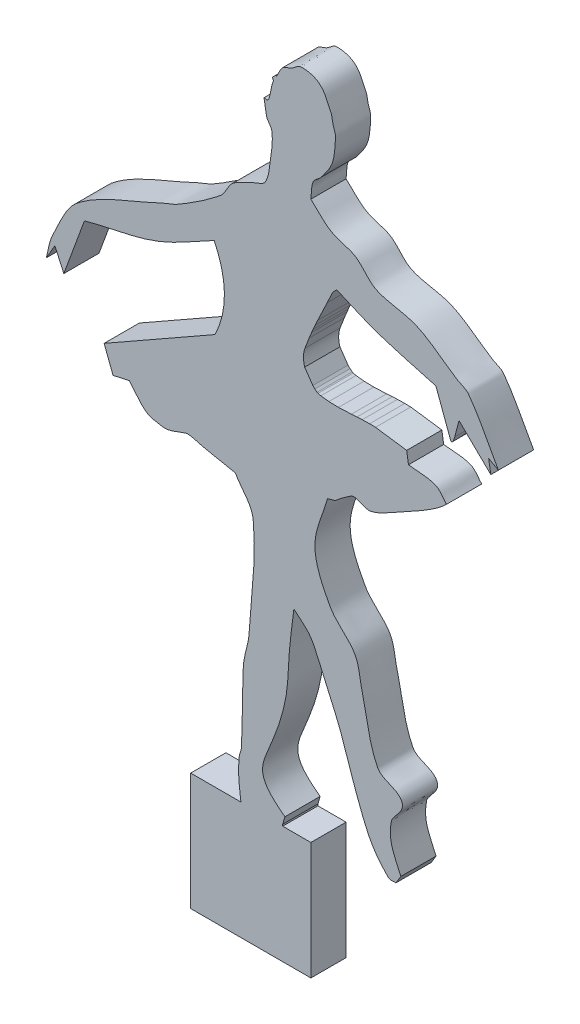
from build123d import *

# Parameters (mm, degrees)
SALIENTE_EXTRUIR3_DEPTH = 3


with BuildPart() as part:
    # Croquis4 → Saliente-Extruir3 (new body)
    with BuildSketch(Plane.XY):
        with BuildLine():
            Line((1085.951599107, -9982.107301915), (1079.1048503, -9982.107301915))
            add(Edge.make_bspline(
                [(1078.426108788, -9984.15867554), (1078.917625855, -9983.140770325), (1079.1048503, -9982.107301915)],
                knots=[0, 0, 0, 0.15063662, 0.15063662, 0.15063662], degree=2))
            Line((1078.426108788, -9984.15867554), (1068.970269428, -9989.534777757))
            Line((1068.970269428, -9989.534777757), (1069.732837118, -9991.517453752))
            Line((1069.732837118, -9991.517453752), (1071.10545896, -9991.212426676))
            add(Edge.make_bspline(
                [(1080.141886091, -9993.500129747), (1079.191772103, -9993.332462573), (1078.261657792, -9993.132828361), (1077.320385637, -9992.928203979), (1076.889270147, -9992.834483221), (1076.46489171, -9992.644668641), (1076.024020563, -9992.661305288), (1075.726929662, -9992.672516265), (1074.604756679, -9993.311406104), (1073.965087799, -9993.195102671), (1073.497882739, -9993.110156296), (1072.98270857, -9993.084387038), (1072.592465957, -9992.813818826), (1071.993834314, -9992.398767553), (1071.601127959, -9991.746224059), (1071.10545896, -9991.212426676)],
                knots=[0, 0, 0, 0, 1, 1, 1, 2, 2, 2, 3, 3, 3, 4, 4, 4, 5, 5, 5, 5], degree=3))
            add(Edge.make_bspline(
                [(1080.599426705, -10017.368498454), (1080.458520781, -10016.335188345), (1080.342546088, -10015.275063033), (1080.485041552, -10014.241970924), (1080.520842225, -10013.982416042), (1080.662526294, -10013.741084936), (1080.675683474, -10013.479403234), (1080.777192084, -10011.460509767), (1080.712324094, -10009.435110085), (1080.828197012, -10007.416990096), (1080.880066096, -10006.513603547), (1081.272243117, -10005.651403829), (1081.323866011, -10004.748003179), (1081.487137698, -10001.890748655), (1081.966118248, -9999.015360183), (1081.667021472, -9996.169116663), (1081.559933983, -9995.150058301), (1080.650264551, -9994.389792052), (1080.141886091, -9993.500129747)],
                knots=[0, 0, 0, 0, 1, 1, 1, 2, 2, 2, 3, 3, 3, 4, 4, 4, 5, 5, 5, 6, 6, 6, 6], degree=3))
            Line((1080.599426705, -10017.368498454), (1080.627246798, -10017.549329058))
            Line((1080.627246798, -10017.549329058), (1076.345583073, -10017.549329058))
            Line((1076.345583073, -10017.549329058), (1076.345583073, -10027.549329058))
            Line((1076.345583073, -10027.549329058), (1086.585583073, -10027.549329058))
            Line((1086.585583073, -10027.549329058), (1086.585583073, -10017.549329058))
            Line((1086.585583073, -10017.549329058), (1084.184344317, -10017.549329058))
            Line((1084.184344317, -10017.549329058), (1084.184344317, -10017.405815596))
            Line((1084.184344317, -10017.405815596), (1084.37498624, -10016.757633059))
            add(Edge.make_bspline(
                [(1085.13755393, -10001.048738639), (1085.023168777, -10001.98923879), (1084.893066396, -10002.927960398), (1084.794398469, -10003.870239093), (1084.638854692, -10005.355682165), (1084.693365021, -10006.872024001), (1084.37498624, -10008.331260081), (1083.225212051, -10013.601058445), (1080.734087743, -10014.06067121), (1084.37498624, -10016.757633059)],
                knots=[0, 0, 0, 0, 1, 1, 1, 2, 2, 2, 3, 3, 3, 3], degree=3))
            add(Edge.make_bspline(
                [(1093.8308256, -10016.910146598), (1093.614764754, -10016.884727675), (1093.337783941, -10016.9864012), (1093.182643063, -10016.833889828), (1091.726656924, -10015.40258142), (1091.293252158, -10014.186570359), (1090.589912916, -10012.334740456), (1089.889001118, -10010.489301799), (1089.388354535, -10008.564035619), (1088.569108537, -10006.767996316), (1086.402775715, -10002.018728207), (1087.081219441, -10002.693378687), (1085.13755393, -10001.048738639)],
                knots=[0, 0, 0, 0, 1, 1, 1, 2, 2, 2, 3, 3, 3, 4, 4, 4, 4], degree=3))
            Line((1093.8308256, -10016.910146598), (1094.25023783, -10016.223835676))
            add(Edge.make_bspline(
                [(1087.997182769, -9991.478514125), (1087.641317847, -9992.851135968), (1086.888304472, -9994.178978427), (1086.929588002, -9995.596379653), (1086.967970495, -9996.914178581), (1087.591159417, -9998.177494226), (1088.225953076, -9999.332961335), (1088.742365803, -10000.272948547), (1089.796504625, -10000.838808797), (1090.323014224, -10001.773177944), (1090.722524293, -10002.482167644), (1090.72616077, -10003.350077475), (1090.933068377, -10004.137137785), (1091.374346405, -10005.815724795), (1091.47633405, -10007.625306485), (1092.267561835, -10009.170084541), (1092.606643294, -10009.832100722), (1093.624574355, -10009.849974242), (1094.135852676, -10010.390192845), (1094.932129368, -10011.231541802), (1093.565593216, -10011.945125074), (1093.449541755, -10012.525382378), (1093.132073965, -10014.112721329), (1093.67794881, -10014.910937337), (1094.25023783, -10016.223835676)],
                knots=[0, 0, 0, 0, 1, 1, 1, 2, 2, 2, 3, 3, 3, 4, 4, 4, 5, 5, 5, 6, 6, 6, 7, 7, 7, 8, 8, 8, 8], degree=3))
            add(Edge.make_bspline(
                [(1098.13933305, -9986.826851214), (1097.427795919, -9987.597683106), (1095.405780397, -9988.721620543), (1094.440879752, -9989.228939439), (1093.540299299, -9989.702440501), (1092.685250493, -9990.326976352), (1091.695636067, -9990.563432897), (1091.132679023, -9990.697944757), (1090.461452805, -9989.975471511), (1089.979858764, -9990.296534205), (1088.195949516, -9991.485807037), (1089.158169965, -9991.146803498), (1087.997182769, -9991.478514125)],
                knots=[0, 0, 0, 0, 1, 1, 1, 2, 2, 2, 3, 3, 3, 4, 4, 4, 4], degree=3))
            add(Edge.make_bspline(
                [(1094.898420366, -9985.53048614), (1095.660988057, -9985.644871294), (1096.470176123, -9985.587262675), (1097.186123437, -9985.873641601), (1097.603331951, -9986.040525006), (1097.821596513, -9986.509114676), (1098.13933305, -9986.826851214)],
                knots=[0, 0, 0, 0, 1, 1, 1, 2, 2, 2, 2], degree=3))
            Line((1094.898420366, -9985.53048614), (1094.745906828, -9984.539148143))
            Line((1094.745906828, -9984.539148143), (1092.091521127, -9984.168477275))
            Line((1092.091521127, -9984.168477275), (1091.587528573, -9984.156593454))
            Line((1091.587528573, -9984.156593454), (1090.959511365, -9984.173040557))
            Line((1090.959511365, -9984.173040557), (1090.510444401, -9984.196602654))
            Line((1090.510444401, -9984.196602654), (1090.040912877, -9984.225142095))
            Line((1090.040912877, -9984.225142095), (1088.941909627, -9984.27319755))
            Line((1088.941909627, -9984.27319755), (1088.11724264, -9984.253752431))
            Line((1088.11724264, -9984.253752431), (1087.434696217, -9984.173273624))
            Line((1087.434696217, -9984.173273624), (1087.195075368, -9984.111343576))
            Line((1087.195075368, -9984.111343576), (1087.112748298, -9984.071028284))
            Line((1087.112748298, -9984.071028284), (1086.920421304, -9983.930750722))
            Line((1086.920421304, -9983.930750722), (1086.752390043, -9983.752833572))
            Line((1086.752390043, -9983.752833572), (1086.056693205, -9982.747114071))
            add(Edge.make_bspline(
                [(1086.056693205, -9982.747114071), (1085.958835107, -9982.41933572), (1085.951599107, -9982.107301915)],
                knots=[0, 0, 0, 0.439548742, 0.439548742, 0.439548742], degree=2))
        make_face()
        with BuildLine():
            add(Edge.make_bspline(
                [(1079.1048503, -9982.107301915), (1079.536655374, -9979.72376219), (1078.349852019, -9977.257437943)],
                knots=[0.15063662, 0.15063662, 0.15063662, 0.498057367, 0.498057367, 0.498057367], degree=2))
            Line((1079.1048503, -9982.107301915), (1085.951599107, -9982.107301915))
            add(Edge.make_bspline(
                [(1085.951599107, -9982.107301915), (1085.942372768, -9981.709439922), (1086.080477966, -9981.337175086)],
                knots=[0.439548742, 0.439548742, 0.439548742, 1, 1, 1], degree=2))
            Line((1086.080477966, -9981.337175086), (1086.431008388, -9980.418287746))
            Line((1086.431008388, -9980.418287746), (1086.658786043, -9979.871473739))
            Line((1086.658786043, -9979.871473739), (1086.784980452, -9979.580304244))
            Line((1086.784980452, -9979.580304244), (1086.94603282, -9979.218145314))
            Line((1086.94603282, -9979.218145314), (1087.16605149, -9978.73662482))
            Line((1087.16605149, -9978.73662482), (1087.97379349, -9977.032685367))
            Line((1087.97379349, -9977.032685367), (1088.462336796, -9975.996814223))
            Line((1088.462336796, -9975.996814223), (1088.800425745, -9975.677511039))
            add(Edge.make_bspline(
                [(1092.835296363, -9977.29773343), (1092.635947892, -9977.233444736), (1092.437265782, -9977.167066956), (1092.239397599, -9977.098137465), (1091.068069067, -9976.69009269), (1089.938326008, -9976.173118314), (1088.800425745, -9975.677511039)],
                knots=[0.879133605, 0.879133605, 0.879133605, 0.879133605, 1, 1, 1, 1.797436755, 1.797436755, 1.797436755, 1.797436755], degree=3))
            Line((1092.835296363, -9977.29773343), (1094.619892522, -9977.825895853))
            Line((1094.619892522, -9977.825895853), (1095.768969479, -9978.139294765))
            add(Edge.make_bspline(
                [(1097.23421597, -9978.547016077), (1096.747485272, -9978.405827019), (1096.258373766, -9978.272101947), (1095.768969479, -9978.139294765)],
                knots=[0, 0, 0, 0, 0.29234138, 0.29234138, 0.29234138, 0.29234138], degree=3))
            Line((1097.23421597, -9978.547016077), (1098.483074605, -9981.905735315))
            add(Edge.make_bspline(
                [(1098.483074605, -9981.905735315), (1098.5936536, -9982.096410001), (1098.713051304, -9981.959335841), (1098.841267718, -9981.494512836)],
                knots=[0.232918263, 0.232918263, 0.232918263, 0.232918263, 1, 1, 1, 1], degree=3))
            Line((1098.841267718, -9981.494512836), (1099.206927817, -9980.116255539))
            Line((1099.206927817, -9980.116255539), (1101.914043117, -9982.747114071))
            Line((1101.914043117, -9982.747114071), (1101.730393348, -9981.645215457))
            Line((1101.730393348, -9981.645215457), (1102.561376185, -9982.099742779))
            add(Edge.make_bspline(
                [(1086.585583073, -9970.089301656), (1087.144799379, -9970.584970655), (1087.627035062, -9971.184308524), (1088.263231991, -9971.576308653), (1088.904195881, -9971.971245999), (1089.719754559, -9972.019506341), (1090.36029314, -9972.415133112), (1091.034709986, -9972.831684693), (1091.438263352, -9973.634207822), (1092.152327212, -9973.978396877), (1093.24687657, -9974.505985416), (1094.556544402, -9974.461337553), (1095.660138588, -9974.969734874), (1096.844793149, -9975.515474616), (1097.842327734, -9976.39912404), (1098.939179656, -9977.104924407), (1099.303980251, -9977.33966566), (1099.790232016, -9977.440057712), (1100.044902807, -9977.791235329), (1101.02131111, -9979.137650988), (1101.722551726, -9980.663573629), (1102.561376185, -9982.099742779)],
                knots=[0, 0, 0, 0, 1, 1, 1, 2, 2, 2, 3, 3, 3, 4, 4, 4, 5, 5, 5, 6, 6, 6, 7, 7, 7, 7], degree=3))
            add(Edge.make_bspline(
                [(1083.649697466, -9962.501753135), (1083.759149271, -9962.255486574), (1083.997757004, -9961.795626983), (1084.18349485, -9961.586671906), (1084.297509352, -9961.458405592), (1084.775409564, -9961.341032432), (1084.94606254, -9961.243516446), (1085.228046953, -9961.082382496), (1085.460153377, -9960.753085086), (1085.784887, -9960.747847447), (1086.315580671, -9960.739287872), (1086.898671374, -9960.869978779), (1087.310022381, -9961.205388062), (1087.783030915, -9961.591071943), (1087.997400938, -9962.219267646), (1088.263231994, -9962.768651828), (1088.382732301, -9963.01561913), (1088.388726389, -9963.302835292), (1088.453873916, -9963.569347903), (1088.528532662, -9963.874770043), (1088.697599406, -9964.170370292), (1088.682644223, -9964.484429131), (1088.593636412, -9966.353593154), (1088.485588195, -9966.725977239), (1087.462535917, -9968.030368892), (1087.26287259, -9968.284939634), (1086.903004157, -9968.41902439), (1086.776224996, -9968.716679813), (1086.595211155, -9969.141668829), (1086.64913038, -9969.631761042), (1086.585583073, -9970.089301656)],
                knots=[0, 0, 0, 0, 1, 1, 1, 2, 2, 2, 3, 3, 3, 4, 4, 4, 5, 5, 5, 6, 6, 6, 7, 7, 7, 8, 8, 8, 9, 9, 9, 10, 10, 10, 10], degree=3))
            Line((1083.649697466, -9962.501753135), (1083.573440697, -9962.46362475))
            Line((1083.573440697, -9962.46362475), (1083.306542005, -9962.730523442))
            Line((1083.306542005, -9962.730523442), (1083.402831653, -9962.94717515))
            add(Edge.make_bspline(
                [(1064.051707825, -9985.683810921), (1064.220717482, -9985.058566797), (1064.269208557, -9984.387447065), (1064.558736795, -9983.808078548), (1065.179674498, -9982.565533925), (1065.659282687, -9981.118440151), (1066.757924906, -9980.268460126), (1068.745119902, -9978.731038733), (1071.237970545, -9977.992029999), (1073.497198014, -9976.892712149), (1074.091471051, -9976.603544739), (1074.749483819, -9976.443953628), (1075.316269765, -9976.104053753), (1076.558743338, -9975.358945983), (1077.791945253, -9974.579298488), (1078.903749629, -9973.650418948), (1079.342653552, -9973.283727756), (1079.474433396, -9972.629732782), (1079.913484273, -9972.263217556), (1080.428374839, -9971.833392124), (1081.103426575, -9971.643773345), (1081.692250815, -9971.322606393), (1082.036876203, -9971.134634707), (1082.523565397, -9971.079603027), (1082.713434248, -9970.736019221), (1083.06084799, -9970.107344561), (1083.080009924, -9969.3435032), (1083.17906765, -9968.632085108), (1083.265113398, -9968.01411713), (1083.350903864, -9967.380575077), (1083.266727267, -9966.762349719), (1083.21917776, -9966.413127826), (1082.862514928, -9966.161814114), (1082.795603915, -9965.815779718), (1082.360023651, -9963.563149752), (1082.768661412, -9965.223327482), (1083.041758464, -9964.363232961), (1083.189176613, -9963.898952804), (1083.191236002, -9963.385940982), (1083.402831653, -9962.94717515)],
                knots=[0, 0, 0, 0, 1, 1, 1, 2, 2, 2, 3, 3, 3, 4, 4, 4, 5, 5, 5, 6, 6, 6, 7, 7, 7, 8, 8, 8, 9, 9, 9, 10, 10, 10, 11, 11, 11, 12, 12, 12, 13, 13, 13, 13], degree=3))
            Line((1064.051707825, -9985.683810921), (1064.776147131, -9984.425574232))
            Line((1064.776147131, -9984.425574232), (1065.538714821, -9986.103223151))
            Line((1065.538714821, -9986.103223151), (1067.292620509, -9981.337175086))
            add(Edge.make_bspline(
                [(1078.349852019, -9977.257437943), (1076.735750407, -9978.083552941), (1075.200792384, -9979.087160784), (1073.507547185, -9979.735782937), (1071.509796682, -9980.501050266), (1069.34961693, -9980.749461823), (1067.292620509, -9981.337175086)],
                knots=[0, 0, 0, 0, 1, 1, 1, 2, 2, 2, 2], degree=3))
        make_face()
    extrude(amount=SALIENTE_EXTRUIR3_DEPTH)


solid = part.part
